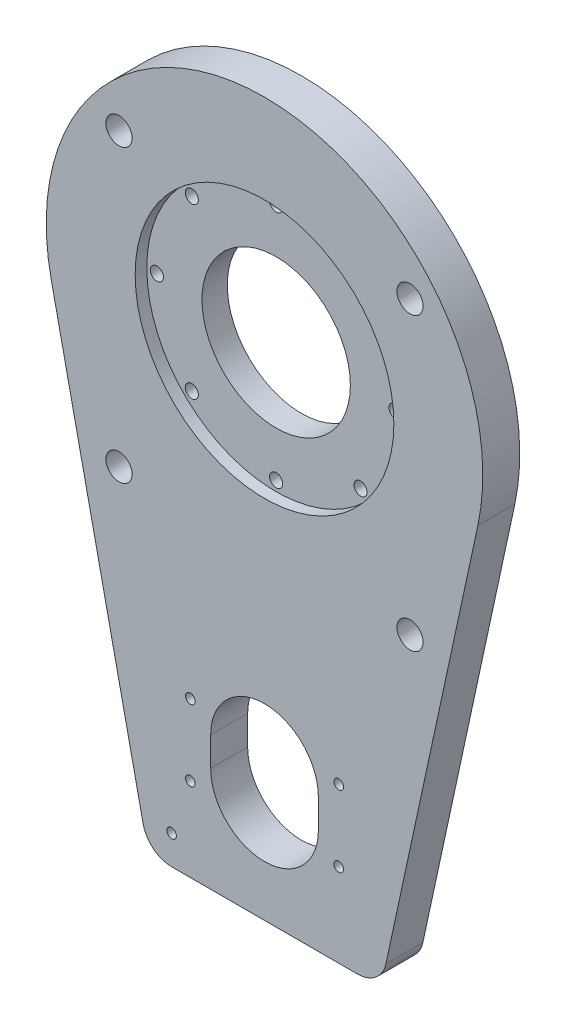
ISO-10303-21;
HEADER;
FILE_DESCRIPTION(('STEP AP214'),'2;1');
FILE_NAME('part.step','',(''),(''),'','','');
FILE_SCHEMA(('AUTOMOTIVE_DESIGN { 1 0 10303 214 1 1 1 1 }'));
ENDSEC;
DATA;
#1=APPLICATION_CONTEXT('core data for automotive mechanical design processes');
#2=APPLICATION_PROTOCOL_DEFINITION('international standard','automotive_design',2000,#1);
#3=PRODUCT_CONTEXT('',#1,'mechanical');
#4=PRODUCT('Part','Part','',(#3));
#5=PRODUCT_RELATED_PRODUCT_CATEGORY('part','',(#4));
#6=PRODUCT_DEFINITION_FORMATION('','',#4);
#7=PRODUCT_DEFINITION_CONTEXT('part definition',#1,'design');
#8=PRODUCT_DEFINITION('design','',#6,#7);
#9=PRODUCT_DEFINITION_SHAPE('','',#8);
#10=(LENGTH_UNIT() NAMED_UNIT(*) SI_UNIT(.MILLI.,.METRE.));
#11=(NAMED_UNIT(*) PLANE_ANGLE_UNIT() SI_UNIT($,.RADIAN.));
#12=(NAMED_UNIT(*) SI_UNIT($,.STERADIAN.) SOLID_ANGLE_UNIT());
#13=UNCERTAINTY_MEASURE_WITH_UNIT(LENGTH_MEASURE(1.E-05),#10,'distance_accuracy_value','');
#14=(GEOMETRIC_REPRESENTATION_CONTEXT(3) GLOBAL_UNCERTAINTY_ASSIGNED_CONTEXT((#13)) GLOBAL_UNIT_ASSIGNED_CONTEXT((#10,
#11,#12)) REPRESENTATION_CONTEXT('',''));
#15=CARTESIAN_POINT('',(0.,0.,0.));
#16=DIRECTION('',(0.,0.,1.));
#17=DIRECTION('',(1.,0.,0.));
#18=AXIS2_PLACEMENT_3D('',#15,#16,#17);
#19=CARTESIAN_POINT('',(0.,0.,0.));
#20=DIRECTION('',(0.,0.,1.));
#21=DIRECTION('',(1.,0.,0.));
#22=AXIS2_PLACEMENT_3D('',#19,#20,#21);
#23=PLANE('',#22);
#24=CARTESIAN_POINT('',(-28.9913780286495,28.9913780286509,0.));
#25=DIRECTION('',(0.,0.,-1.));
#26=DIRECTION('',(-1.,0.,0.));
#27=AXIS2_PLACEMENT_3D('',#24,#25,#26);
#28=CIRCLE('',#27,4.12500000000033);
#29=CARTESIAN_POINT('',(-33.1163780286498,28.9913780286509,0.));
#30=VERTEX_POINT('',#29);
#31=EDGE_CURVE('E420',#30,#30,#28,.T.);
#32=ORIENTED_EDGE('',*,*,#31,.F.);
#33=EDGE_LOOP('',(#32));
#34=FACE_BOUND('',#33,.T.);
#35=CARTESIAN_POINT('',(-41.0000000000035,3.49084920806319E-12,0.));
#36=DIRECTION('',(0.,0.,-1.));
#37=DIRECTION('',(-1.,0.,0.));
#38=AXIS2_PLACEMENT_3D('',#35,#36,#37);
#39=CIRCLE('',#38,4.12500000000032);
#40=CARTESIAN_POINT('',(-45.1250000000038,3.49084920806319E-12,0.));
#41=VERTEX_POINT('',#40);
#42=EDGE_CURVE('E221',#41,#41,#39,.T.);
#43=ORIENTED_EDGE('',*,*,#42,.F.);
#44=EDGE_LOOP('',(#43));
#45=FACE_BOUND('',#44,.T.);
#46=CARTESIAN_POINT('',(-28.9913780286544,-28.991378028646,0.));
#47=DIRECTION('',(0.,0.,-1.));
#48=DIRECTION('',(-1.,0.,0.));
#49=AXIS2_PLACEMENT_3D('',#46,#47,#48);
#50=CIRCLE('',#49,4.12500000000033);
#51=CARTESIAN_POINT('',(-33.1163780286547,-28.991378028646,0.));
#52=VERTEX_POINT('',#51);
#53=EDGE_CURVE('E216',#52,#52,#50,.T.);
#54=ORIENTED_EDGE('',*,*,#53,.F.);
#55=EDGE_LOOP('',(#54));
#56=FACE_BOUND('',#55,.T.);
#57=CARTESIAN_POINT('',(-6.98169841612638E-12,-41.,0.));
#58=DIRECTION('',(0.,0.,-1.));
#59=DIRECTION('',(-1.,0.,0.));
#60=AXIS2_PLACEMENT_3D('',#57,#58,#59);
#61=CIRCLE('',#60,4.12500000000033);
#62=CARTESIAN_POINT('',(-4.12500000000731,-41.,0.));
#63=VERTEX_POINT('',#62);
#64=EDGE_CURVE('E211',#63,#63,#61,.T.);
#65=ORIENTED_EDGE('',*,*,#64,.F.);
#66=EDGE_LOOP('',(#65));
#67=FACE_BOUND('',#66,.T.);
#68=CARTESIAN_POINT('',(28.9913780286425,-28.9913780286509,0.));
#69=DIRECTION('',(0.,0.,-1.));
#70=DIRECTION('',(-1.,0.,0.));
#71=AXIS2_PLACEMENT_3D('',#68,#69,#70);
#72=CIRCLE('',#71,4.12500000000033);
#73=CARTESIAN_POINT('',(24.8663780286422,-28.9913780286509,0.));
#74=VERTEX_POINT('',#73);
#75=EDGE_CURVE('E206',#74,#74,#72,.T.);
#76=ORIENTED_EDGE('',*,*,#75,.F.);
#77=EDGE_LOOP('',(#76));
#78=FACE_BOUND('',#77,.T.);
#79=CARTESIAN_POINT('',(40.9999999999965,-3.49587025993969E-12,0.));
#80=DIRECTION('',(0.,0.,-1.));
#81=DIRECTION('',(-1.,0.,0.));
#82=AXIS2_PLACEMENT_3D('',#79,#80,#81);
#83=CIRCLE('',#82,4.12500000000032);
#84=CARTESIAN_POINT('',(36.8749999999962,-3.49587025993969E-12,0.));
#85=VERTEX_POINT('',#84);
#86=EDGE_CURVE('E201',#85,#85,#83,.T.);
#87=ORIENTED_EDGE('',*,*,#86,.F.);
#88=EDGE_LOOP('',(#87));
#89=FACE_BOUND('',#88,.T.);
#90=CARTESIAN_POINT('',(28.9913780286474,28.991378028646,0.));
#91=DIRECTION('',(0.,0.,-1.));
#92=DIRECTION('',(-1.,0.,0.));
#93=AXIS2_PLACEMENT_3D('',#90,#91,#92);
#94=CIRCLE('',#93,4.12500000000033);
#95=CARTESIAN_POINT('',(24.8663780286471,28.991378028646,0.));
#96=VERTEX_POINT('',#95);
#97=EDGE_CURVE('E196',#96,#96,#94,.T.);
#98=ORIENTED_EDGE('',*,*,#97,.F.);
#99=EDGE_LOOP('',(#98));
#100=FACE_BOUND('',#99,.T.);
#101=CARTESIAN_POINT('',(0.,41.,0.));
#102=DIRECTION('',(0.,0.,-1.));
#103=DIRECTION('',(-1.,0.,0.));
#104=AXIS2_PLACEMENT_3D('',#101,#102,#103);
#105=CIRCLE('',#104,4.12500000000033);
#106=CARTESIAN_POINT('',(-4.12500000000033,41.,0.));
#107=VERTEX_POINT('',#106);
#108=EDGE_CURVE('E191',#107,#107,#105,.T.);
#109=ORIENTED_EDGE('',*,*,#108,.F.);
#110=EDGE_LOOP('',(#109));
#111=FACE_BOUND('',#110,.T.);
#112=CARTESIAN_POINT('',(0.,0.,0.));
#113=DIRECTION('',(0.,0.,1.));
#114=DIRECTION('',(1.,0.,0.));
#115=AXIS2_PLACEMENT_3D('',#112,#113,#114);
#116=CIRCLE('',#115,25.5);
#117=CARTESIAN_POINT('',(25.5,0.,0.));
#118=VERTEX_POINT('',#117);
#119=EDGE_CURVE('E356',#118,#118,#116,.T.);
#120=ORIENTED_EDGE('',*,*,#119,.T.);
#121=EDGE_LOOP('',(#120));
#122=FACE_BOUND('',#121,.T.);
#123=CARTESIAN_POINT('',(-31.9298733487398,-160.,0.));
#124=DIRECTION('',(0.,0.,1.));
#125=DIRECTION('',(1.,0.,0.));
#126=AXIS2_PLACEMENT_3D('',#123,#124,#125);
#127=CIRCLE('',#126,1.64999999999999);
#128=CARTESIAN_POINT('',(-30.2798733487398,-160.,0.));
#129=VERTEX_POINT('',#128);
#130=EDGE_CURVE('E352',#129,#129,#127,.T.);
#131=ORIENTED_EDGE('',*,*,#130,.T.);
#132=EDGE_LOOP('',(#131));
#133=FACE_BOUND('',#132,.T.);
#134=CARTESIAN_POINT('',(-25.5,-116.75,0.));
#135=DIRECTION('',(0.,0.,1.));
#136=DIRECTION('',(1.,0.,0.));
#137=AXIS2_PLACEMENT_3D('',#134,#135,#136);
#138=CIRCLE('',#137,1.64999999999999);
#139=CARTESIAN_POINT('',(-23.85,-116.75,0.));
#140=VERTEX_POINT('',#139);
#141=EDGE_CURVE('E348',#140,#140,#138,.T.);
#142=ORIENTED_EDGE('',*,*,#141,.T.);
#143=EDGE_LOOP('',(#142));
#144=FACE_BOUND('',#143,.T.);
#145=CARTESIAN_POINT('',(-25.5,-141.25,0.));
#146=DIRECTION('',(0.,0.,1.));
#147=DIRECTION('',(1.,0.,0.));
#148=AXIS2_PLACEMENT_3D('',#145,#146,#147);
#149=CIRCLE('',#148,1.64999999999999);
#150=CARTESIAN_POINT('',(-23.85,-141.25,0.));
#151=VERTEX_POINT('',#150);
#152=EDGE_CURVE('E344',#151,#151,#149,.T.);
#153=ORIENTED_EDGE('',*,*,#152,.T.);
#154=EDGE_LOOP('',(#153));
#155=FACE_BOUND('',#154,.T.);
#156=CARTESIAN_POINT('',(25.5,-116.75,0.));
#157=DIRECTION('',(0.,0.,1.));
#158=DIRECTION('',(1.,0.,0.));
#159=AXIS2_PLACEMENT_3D('',#156,#157,#158);
#160=CIRCLE('',#159,1.64999999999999);
#161=CARTESIAN_POINT('',(27.15,-116.75,0.));
#162=VERTEX_POINT('',#161);
#163=EDGE_CURVE('E340',#162,#162,#160,.T.);
#164=ORIENTED_EDGE('',*,*,#163,.T.);
#165=EDGE_LOOP('',(#164));
#166=FACE_BOUND('',#165,.T.);
#167=CARTESIAN_POINT('',(25.5,-141.25,0.));
#168=DIRECTION('',(0.,0.,1.));
#169=DIRECTION('',(1.,0.,0.));
#170=AXIS2_PLACEMENT_3D('',#167,#168,#169);
#171=CIRCLE('',#170,1.64999999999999);
#172=CARTESIAN_POINT('',(27.15,-141.25,0.));
#173=VERTEX_POINT('',#172);
#174=EDGE_CURVE('E336',#173,#173,#171,.T.);
#175=ORIENTED_EDGE('',*,*,#174,.T.);
#176=EDGE_LOOP('',(#175));
#177=FACE_BOUND('',#176,.T.);
#178=CARTESIAN_POINT('',(50.,-60.,0.));
#179=DIRECTION('',(0.,0.,-1.));
#180=DIRECTION('',(-1.,0.,0.));
#181=AXIS2_PLACEMENT_3D('',#178,#179,#180);
#182=CIRCLE('',#181,4.50000000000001);
#183=CARTESIAN_POINT('',(45.5,-60.,0.));
#184=VERTEX_POINT('',#183);
#185=EDGE_CURVE('E333',#184,#184,#182,.T.);
#186=ORIENTED_EDGE('',*,*,#185,.F.);
#187=EDGE_LOOP('',(#186));
#188=FACE_BOUND('',#187,.T.);
#189=CARTESIAN_POINT('',(-50.,-60.,0.));
#190=DIRECTION('',(0.,0.,-1.));
#191=DIRECTION('',(-1.,0.,0.));
#192=AXIS2_PLACEMENT_3D('',#189,#190,#191);
#193=CIRCLE('',#192,4.50000000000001);
#194=CARTESIAN_POINT('',(-54.5,-60.,0.));
#195=VERTEX_POINT('',#194);
#196=EDGE_CURVE('E329',#195,#195,#193,.T.);
#197=ORIENTED_EDGE('',*,*,#196,.F.);
#198=EDGE_LOOP('',(#197));
#199=FACE_BOUND('',#198,.T.);
#200=CARTESIAN_POINT('',(50.,40.,0.));
#201=DIRECTION('',(0.,0.,-1.));
#202=DIRECTION('',(-1.,0.,0.));
#203=AXIS2_PLACEMENT_3D('',#200,#201,#202);
#204=CIRCLE('',#203,4.50000000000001);
#205=CARTESIAN_POINT('',(45.5,40.,0.));
#206=VERTEX_POINT('',#205);
#207=EDGE_CURVE('E319',#206,#206,#204,.T.);
#208=ORIENTED_EDGE('',*,*,#207,.F.);
#209=EDGE_LOOP('',(#208));
#210=FACE_BOUND('',#209,.T.);
#211=DIRECTION('',(0.,-1.,0.));
#212=VECTOR('',#211,1.);
#213=CARTESIAN_POINT('',(18.5,-124.,0.));
#214=LINE('',#213,#212);
#215=CARTESIAN_POINT('',(18.5,-124.,0.));
#216=VERTEX_POINT('',#215);
#217=CARTESIAN_POINT('',(18.5,-134.,0.));
#218=VERTEX_POINT('',#217);
#219=EDGE_CURVE('E147',#216,#218,#214,.T.);
#220=ORIENTED_EDGE('',*,*,#219,.F.);
#221=CARTESIAN_POINT('',(0.,-124.,0.));
#222=DIRECTION('',(0.,0.,-1.));
#223=DIRECTION('',(-1.,0.,0.));
#224=AXIS2_PLACEMENT_3D('',#221,#222,#223);
#225=CIRCLE('',#224,18.5);
#226=CARTESIAN_POINT('',(-18.5,-124.,0.));
#227=VERTEX_POINT('',#226);
#228=EDGE_CURVE('E117',#227,#216,#225,.T.);
#229=ORIENTED_EDGE('',*,*,#228,.F.);
#230=DIRECTION('',(0.,1.,0.));
#231=VECTOR('',#230,1.);
#232=CARTESIAN_POINT('',(-18.5,-134.,0.));
#233=LINE('',#232,#231);
#234=CARTESIAN_POINT('',(-18.5,-134.,0.));
#235=VERTEX_POINT('',#234);
#236=EDGE_CURVE('E135',#235,#227,#233,.T.);
#237=ORIENTED_EDGE('',*,*,#236,.F.);
#238=CARTESIAN_POINT('',(0.,-134.,0.));
#239=DIRECTION('',(0.,0.,-1.));
#240=DIRECTION('',(-1.,0.,0.));
#241=AXIS2_PLACEMENT_3D('',#238,#239,#240);
#242=CIRCLE('',#241,18.5);
#243=EDGE_CURVE('E138',#218,#235,#242,.T.);
#244=ORIENTED_EDGE('',*,*,#243,.F.);
#245=EDGE_LOOP('',(#220,#229,#237,#244));
#246=FACE_BOUND('',#245,.T.);
#247=DIRECTION('',(1.,0.,0.));
#248=VECTOR('',#247,1.);
#249=CARTESIAN_POINT('',(-40.,-170.,0.));
#250=LINE('',#249,#248);
#251=CARTESIAN_POINT('',(-31.9298733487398,-170.,0.));
#252=VERTEX_POINT('',#251);
#253=CARTESIAN_POINT('',(31.9298733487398,-170.,0.));
#254=VERTEX_POINT('',#253);
#255=EDGE_CURVE('E157',#252,#254,#250,.T.);
#256=ORIENTED_EDGE('',*,*,#255,.F.);
#257=CARTESIAN_POINT('',(-31.9298733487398,-160.,0.));
#258=DIRECTION('',(0.,0.,1.));
#259=DIRECTION('',(1.,0.,0.));
#260=AXIS2_PLACEMENT_3D('',#257,#258,#259);
#261=CIRCLE('',#260,10.);
#262=CARTESIAN_POINT('',(-41.7043249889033,-162.111893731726,0.));
#263=VERTEX_POINT('',#262);
#264=EDGE_CURVE('E41',#252,#263,#261,.F.);
#265=ORIENTED_EDGE('',*,*,#264,.T.);
#266=DIRECTION('',(0.211189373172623,-0.977445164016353,0.));
#267=VECTOR('',#266,1.);
#268=CARTESIAN_POINT('',(-73.3083873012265,-15.8392029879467,0.));
#269=LINE('',#268,#267);
#270=CARTESIAN_POINT('',(-73.3083873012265,-15.8392029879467,0.));
#271=VERTEX_POINT('',#270);
#272=EDGE_CURVE('E165',#271,#263,#269,.T.);
#273=ORIENTED_EDGE('',*,*,#272,.F.);
#274=CARTESIAN_POINT('',(0.,0.,0.));
#275=DIRECTION('',(0.,0.,1.));
#276=DIRECTION('',(1.,0.,0.));
#277=AXIS2_PLACEMENT_3D('',#274,#275,#276);
#278=CIRCLE('',#277,75.);
#279=CARTESIAN_POINT('',(73.3083873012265,-15.8392029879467,0.));
#280=VERTEX_POINT('',#279);
#281=EDGE_CURVE('E162',#280,#271,#278,.T.);
#282=ORIENTED_EDGE('',*,*,#281,.F.);
#283=DIRECTION('',(0.211189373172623,0.977445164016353,0.));
#284=VECTOR('',#283,1.);
#285=CARTESIAN_POINT('',(40.,-170.,0.));
#286=LINE('',#285,#284);
#287=CARTESIAN_POINT('',(41.7043249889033,-162.111893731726,0.));
#288=VERTEX_POINT('',#287);
#289=EDGE_CURVE('E159',#288,#280,#286,.T.);
#290=ORIENTED_EDGE('',*,*,#289,.F.);
#291=CARTESIAN_POINT('',(31.9298733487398,-160.,0.));
#292=DIRECTION('',(0.,0.,1.));
#293=DIRECTION('',(1.,0.,0.));
#294=AXIS2_PLACEMENT_3D('',#291,#292,#293);
#295=CIRCLE('',#294,10.);
#296=EDGE_CURVE('E53',#288,#254,#295,.F.);
#297=ORIENTED_EDGE('',*,*,#296,.T.);
#298=EDGE_LOOP('',(#256,#265,#273,#282,#290,#297));
#299=FACE_BOUND('',#298,.T.);
#300=CARTESIAN_POINT('',(-50.,40.,0.));
#301=DIRECTION('',(0.,0.,-1.));
#302=DIRECTION('',(-1.,0.,0.));
#303=AXIS2_PLACEMENT_3D('',#300,#301,#302);
#304=CIRCLE('',#303,4.50000000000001);
#305=CARTESIAN_POINT('',(-54.5,40.,0.));
#306=VERTEX_POINT('',#305);
#307=EDGE_CURVE('E323',#306,#306,#304,.T.);
#308=ORIENTED_EDGE('',*,*,#307,.F.);
#309=EDGE_LOOP('',(#308));
#310=FACE_BOUND('',#309,.T.);
#311=ADVANCED_FACE('F33',(#34,#45,#56,#67,#78,#89,#100,#111,#122,#133,#144,#155,#166,#177,#188,
#199,#210,#246,#299,#310),#23,.F.);
#312=CARTESIAN_POINT('',(-40.,-170.,0.));
#313=DIRECTION('',(0.,-1.,0.));
#314=DIRECTION('',(0.,0.,-1.));
#315=AXIS2_PLACEMENT_3D('',#312,#313,#314);
#316=PLANE('',#315);
#317=DIRECTION('',(1.,0.,0.));
#318=VECTOR('',#317,1.);
#319=CARTESIAN_POINT('',(-40.,-170.,12.7));
#320=LINE('',#319,#318);
#321=CARTESIAN_POINT('',(-31.9298733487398,-170.,12.7));
#322=VERTEX_POINT('',#321);
#323=CARTESIAN_POINT('',(31.9298733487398,-170.,12.7));
#324=VERTEX_POINT('',#323);
#325=EDGE_CURVE('E153',#322,#324,#320,.T.);
#326=ORIENTED_EDGE('',*,*,#325,.F.);
#327=DIRECTION('',(0.,0.,1.));
#328=VECTOR('',#327,1.);
#329=CARTESIAN_POINT('',(-31.9298733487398,-170.,0.));
#330=LINE('',#329,#328);
#331=EDGE_CURVE('E232',#322,#252,#330,.F.);
#332=ORIENTED_EDGE('',*,*,#331,.T.);
#333=ORIENTED_EDGE('',*,*,#255,.T.);
#334=DIRECTION('',(0.,0.,1.));
#335=VECTOR('',#334,1.);
#336=CARTESIAN_POINT('',(31.9298733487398,-170.,0.));
#337=LINE('',#336,#335);
#338=EDGE_CURVE('E229',#254,#324,#337,.T.);
#339=ORIENTED_EDGE('',*,*,#338,.T.);
#340=EDGE_LOOP('',(#326,#332,#333,#339));
#341=FACE_BOUND('',#340,.T.);
#342=ADVANCED_FACE('F247',(#341),#316,.T.);
#343=CARTESIAN_POINT('',(-73.3083873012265,-15.8392029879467,0.));
#344=DIRECTION('',(-0.977445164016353,-0.211189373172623,0.));
#345=DIRECTION('',(0.211189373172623,-0.977445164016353,0.));
#346=AXIS2_PLACEMENT_3D('',#343,#344,#345);
#347=PLANE('',#346);
#348=ORIENTED_EDGE('',*,*,#272,.T.);
#349=DIRECTION('',(0.,0.,1.));
#350=VECTOR('',#349,1.);
#351=CARTESIAN_POINT('',(-41.7043249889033,-162.111893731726,0.));
#352=LINE('',#351,#350);
#353=CARTESIAN_POINT('',(-41.7043249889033,-162.111893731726,12.7));
#354=VERTEX_POINT('',#353);
#355=EDGE_CURVE('E180',#263,#354,#352,.T.);
#356=ORIENTED_EDGE('',*,*,#355,.T.);
#357=DIRECTION('',(0.211189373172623,-0.977445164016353,0.));
#358=VECTOR('',#357,1.);
#359=CARTESIAN_POINT('',(-73.3083873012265,-15.8392029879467,12.7));
#360=LINE('',#359,#358);
#361=CARTESIAN_POINT('',(-73.3083873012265,-15.8392029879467,12.7));
#362=VERTEX_POINT('',#361);
#363=EDGE_CURVE('E160',#362,#354,#360,.T.);
#364=ORIENTED_EDGE('',*,*,#363,.F.);
#365=DIRECTION('',(0.,0.,1.));
#366=VECTOR('',#365,1.);
#367=CARTESIAN_POINT('',(-73.3083873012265,-15.8392029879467,0.));
#368=LINE('',#367,#366);
#369=EDGE_CURVE('E178',#271,#362,#368,.T.);
#370=ORIENTED_EDGE('',*,*,#369,.F.);
#371=EDGE_LOOP('',(#348,#356,#364,#370));
#372=FACE_BOUND('',#371,.T.);
#373=ADVANCED_FACE('F242',(#372),#347,.T.);
#374=CARTESIAN_POINT('',(0.,0.,0.));
#375=DIRECTION('',(0.,0.,1.));
#376=DIRECTION('',(1.,0.,0.));
#377=AXIS2_PLACEMENT_3D('',#374,#375,#376);
#378=CYLINDRICAL_SURFACE('',#377,75.);
#379=CARTESIAN_POINT('',(0.,0.,12.7));
#380=DIRECTION('',(0.,0.,1.));
#381=DIRECTION('',(1.,0.,0.));
#382=AXIS2_PLACEMENT_3D('',#379,#380,#381);
#383=CIRCLE('',#382,75.);
#384=CARTESIAN_POINT('',(73.3083873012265,-15.8392029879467,12.7));
#385=VERTEX_POINT('',#384);
#386=EDGE_CURVE('E173',#385,#362,#383,.T.);
#387=ORIENTED_EDGE('',*,*,#386,.F.);
#388=DIRECTION('',(0.,0.,1.));
#389=VECTOR('',#388,1.);
#390=CARTESIAN_POINT('',(73.3083873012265,-15.8392029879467,0.));
#391=LINE('',#390,#389);
#392=EDGE_CURVE('E168',#280,#385,#391,.T.);
#393=ORIENTED_EDGE('',*,*,#392,.F.);
#394=ORIENTED_EDGE('',*,*,#281,.T.);
#395=ORIENTED_EDGE('',*,*,#369,.T.);
#396=EDGE_LOOP('',(#387,#393,#394,#395));
#397=FACE_BOUND('',#396,.T.);
#398=ADVANCED_FACE('F254',(#397),#378,.T.);
#399=CARTESIAN_POINT('',(40.,-170.,0.));
#400=DIRECTION('',(0.977445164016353,-0.211189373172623,0.));
#401=DIRECTION('',(0.211189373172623,0.977445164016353,0.));
#402=AXIS2_PLACEMENT_3D('',#399,#400,#401);
#403=PLANE('',#402);
#404=DIRECTION('',(0.211189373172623,0.977445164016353,0.));
#405=VECTOR('',#404,1.);
#406=CARTESIAN_POINT('',(40.,-170.,12.7));
#407=LINE('',#406,#405);
#408=CARTESIAN_POINT('',(41.7043249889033,-162.111893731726,12.7));
#409=VERTEX_POINT('',#408);
#410=EDGE_CURVE('E171',#409,#385,#407,.T.);
#411=ORIENTED_EDGE('',*,*,#410,.F.);
#412=DIRECTION('',(0.,0.,1.));
#413=VECTOR('',#412,1.);
#414=CARTESIAN_POINT('',(41.7043249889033,-162.111893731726,0.));
#415=LINE('',#414,#413);
#416=EDGE_CURVE('E11',#409,#288,#415,.F.);
#417=ORIENTED_EDGE('',*,*,#416,.T.);
#418=ORIENTED_EDGE('',*,*,#289,.T.);
#419=ORIENTED_EDGE('',*,*,#392,.T.);
#420=EDGE_LOOP('',(#411,#417,#418,#419));
#421=FACE_BOUND('',#420,.T.);
#422=ADVANCED_FACE('F250',(#421),#403,.T.);
#423=CARTESIAN_POINT('',(0.,0.,12.7));
#424=DIRECTION('',(0.,0.,1.));
#425=DIRECTION('',(1.,0.,0.));
#426=AXIS2_PLACEMENT_3D('',#423,#424,#425);
#427=PLANE('',#426);
#428=CARTESIAN_POINT('',(0.,0.,12.7));
#429=DIRECTION('',(0.,0.,1.));
#430=DIRECTION('',(1.,0.,0.));
#431=AXIS2_PLACEMENT_3D('',#428,#429,#430);
#432=CIRCLE('',#431,44.45);
#433=CARTESIAN_POINT('',(44.45,0.,12.7));
#434=VERTEX_POINT('',#433);
#435=EDGE_CURVE('E186',#434,#434,#432,.T.);
#436=ORIENTED_EDGE('',*,*,#435,.F.);
#437=EDGE_LOOP('',(#436));
#438=FACE_BOUND('',#437,.T.);
#439=CARTESIAN_POINT('',(-31.9298733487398,-160.,12.7));
#440=DIRECTION('',(0.,0.,1.));
#441=DIRECTION('',(1.,0.,0.));
#442=AXIS2_PLACEMENT_3D('',#439,#440,#441);
#443=CIRCLE('',#442,1.64999999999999);
#444=CARTESIAN_POINT('',(-30.2798733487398,-160.,12.7));
#445=VERTEX_POINT('',#444);
#446=EDGE_CURVE('E287',#445,#445,#443,.T.);
#447=ORIENTED_EDGE('',*,*,#446,.F.);
#448=EDGE_LOOP('',(#447));
#449=FACE_BOUND('',#448,.T.);
#450=CARTESIAN_POINT('',(-25.5,-116.75,12.7));
#451=DIRECTION('',(0.,0.,1.));
#452=DIRECTION('',(1.,0.,0.));
#453=AXIS2_PLACEMENT_3D('',#450,#451,#452);
#454=CIRCLE('',#453,1.64999999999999);
#455=CARTESIAN_POINT('',(-23.85,-116.75,12.7));
#456=VERTEX_POINT('',#455);
#457=EDGE_CURVE('E291',#456,#456,#454,.T.);
#458=ORIENTED_EDGE('',*,*,#457,.F.);
#459=EDGE_LOOP('',(#458));
#460=FACE_BOUND('',#459,.T.);
#461=CARTESIAN_POINT('',(-25.5,-141.25,12.7));
#462=DIRECTION('',(0.,0.,1.));
#463=DIRECTION('',(1.,0.,0.));
#464=AXIS2_PLACEMENT_3D('',#461,#462,#463);
#465=CIRCLE('',#464,1.64999999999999);
#466=CARTESIAN_POINT('',(-23.85,-141.25,12.7));
#467=VERTEX_POINT('',#466);
#468=EDGE_CURVE('E295',#467,#467,#465,.T.);
#469=ORIENTED_EDGE('',*,*,#468,.F.);
#470=EDGE_LOOP('',(#469));
#471=FACE_BOUND('',#470,.T.);
#472=CARTESIAN_POINT('',(25.5,-116.75,12.7));
#473=DIRECTION('',(0.,0.,1.));
#474=DIRECTION('',(1.,0.,0.));
#475=AXIS2_PLACEMENT_3D('',#472,#473,#474);
#476=CIRCLE('',#475,1.64999999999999);
#477=CARTESIAN_POINT('',(27.15,-116.75,12.7));
#478=VERTEX_POINT('',#477);
#479=EDGE_CURVE('E299',#478,#478,#476,.T.);
#480=ORIENTED_EDGE('',*,*,#479,.F.);
#481=EDGE_LOOP('',(#480));
#482=FACE_BOUND('',#481,.T.);
#483=CARTESIAN_POINT('',(25.5,-141.25,12.7));
#484=DIRECTION('',(0.,0.,1.));
#485=DIRECTION('',(1.,0.,0.));
#486=AXIS2_PLACEMENT_3D('',#483,#484,#485);
#487=CIRCLE('',#486,1.64999999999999);
#488=CARTESIAN_POINT('',(27.15,-141.25,12.7));
#489=VERTEX_POINT('',#488);
#490=EDGE_CURVE('E303',#489,#489,#487,.T.);
#491=ORIENTED_EDGE('',*,*,#490,.F.);
#492=EDGE_LOOP('',(#491));
#493=FACE_BOUND('',#492,.T.);
#494=CARTESIAN_POINT('',(50.,-60.,12.7));
#495=DIRECTION('',(0.,0.,-1.));
#496=DIRECTION('',(-1.,0.,0.));
#497=AXIS2_PLACEMENT_3D('',#494,#495,#496);
#498=CIRCLE('',#497,4.50000000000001);
#499=CARTESIAN_POINT('',(45.5,-60.,12.7));
#500=VERTEX_POINT('',#499);
#501=EDGE_CURVE('E307',#500,#500,#498,.T.);
#502=ORIENTED_EDGE('',*,*,#501,.T.);
#503=EDGE_LOOP('',(#502));
#504=FACE_BOUND('',#503,.T.);
#505=CARTESIAN_POINT('',(-50.,-60.,12.7));
#506=DIRECTION('',(0.,0.,-1.));
#507=DIRECTION('',(-1.,0.,0.));
#508=AXIS2_PLACEMENT_3D('',#505,#506,#507);
#509=CIRCLE('',#508,4.50000000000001);
#510=CARTESIAN_POINT('',(-54.5,-60.,12.7));
#511=VERTEX_POINT('',#510);
#512=EDGE_CURVE('E311',#511,#511,#509,.T.);
#513=ORIENTED_EDGE('',*,*,#512,.T.);
#514=EDGE_LOOP('',(#513));
#515=FACE_BOUND('',#514,.T.);
#516=CARTESIAN_POINT('',(-50.,40.,12.7));
#517=DIRECTION('',(0.,0.,-1.));
#518=DIRECTION('',(-1.,0.,0.));
#519=AXIS2_PLACEMENT_3D('',#516,#517,#518);
#520=CIRCLE('',#519,4.50000000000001);
#521=CARTESIAN_POINT('',(-54.5,40.,12.7));
#522=VERTEX_POINT('',#521);
#523=EDGE_CURVE('E315',#522,#522,#520,.T.);
#524=ORIENTED_EDGE('',*,*,#523,.T.);
#525=EDGE_LOOP('',(#524));
#526=FACE_BOUND('',#525,.T.);
#527=CARTESIAN_POINT('',(50.,40.,12.7));
#528=DIRECTION('',(0.,0.,-1.));
#529=DIRECTION('',(-1.,0.,0.));
#530=AXIS2_PLACEMENT_3D('',#527,#528,#529);
#531=CIRCLE('',#530,4.50000000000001);
#532=CARTESIAN_POINT('',(45.5,40.,12.7));
#533=VERTEX_POINT('',#532);
#534=EDGE_CURVE('E141',#533,#533,#531,.T.);
#535=ORIENTED_EDGE('',*,*,#534,.T.);
#536=EDGE_LOOP('',(#535));
#537=FACE_BOUND('',#536,.T.);
#538=CARTESIAN_POINT('',(0.,-124.,12.7));
#539=DIRECTION('',(0.,0.,-1.));
#540=DIRECTION('',(-1.,0.,0.));
#541=AXIS2_PLACEMENT_3D('',#538,#539,#540);
#542=CIRCLE('',#541,18.5);
#543=CARTESIAN_POINT('',(-18.5,-124.,12.7));
#544=VERTEX_POINT('',#543);
#545=CARTESIAN_POINT('',(18.5,-124.,12.7));
#546=VERTEX_POINT('',#545);
#547=EDGE_CURVE('E114',#544,#546,#542,.T.);
#548=ORIENTED_EDGE('',*,*,#547,.T.);
#549=DIRECTION('',(0.,-1.,0.));
#550=VECTOR('',#549,1.);
#551=CARTESIAN_POINT('',(18.5,-124.,12.7));
#552=LINE('',#551,#550);
#553=CARTESIAN_POINT('',(18.5,-134.,12.7));
#554=VERTEX_POINT('',#553);
#555=EDGE_CURVE('E126',#546,#554,#552,.T.);
#556=ORIENTED_EDGE('',*,*,#555,.T.);
#557=CARTESIAN_POINT('',(0.,-134.,12.7));
#558=DIRECTION('',(0.,0.,-1.));
#559=DIRECTION('',(-1.,0.,0.));
#560=AXIS2_PLACEMENT_3D('',#557,#558,#559);
#561=CIRCLE('',#560,18.5);
#562=CARTESIAN_POINT('',(-18.5,-134.,12.7));
#563=VERTEX_POINT('',#562);
#564=EDGE_CURVE('E130',#554,#563,#561,.T.);
#565=ORIENTED_EDGE('',*,*,#564,.T.);
#566=DIRECTION('',(0.,1.,0.));
#567=VECTOR('',#566,1.);
#568=CARTESIAN_POINT('',(-18.5,-134.,12.7));
#569=LINE('',#568,#567);
#570=EDGE_CURVE('E122',#563,#544,#569,.T.);
#571=ORIENTED_EDGE('',*,*,#570,.T.);
#572=EDGE_LOOP('',(#548,#556,#565,#571));
#573=FACE_BOUND('',#572,.T.);
#574=ORIENTED_EDGE('',*,*,#363,.T.);
#575=CARTESIAN_POINT('',(-31.9298733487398,-160.,12.7));
#576=DIRECTION('',(0.,0.,1.));
#577=DIRECTION('',(1.,0.,0.));
#578=AXIS2_PLACEMENT_3D('',#575,#576,#577);
#579=CIRCLE('',#578,10.);
#580=EDGE_CURVE('E227',#354,#322,#579,.T.);
#581=ORIENTED_EDGE('',*,*,#580,.T.);
#582=ORIENTED_EDGE('',*,*,#325,.T.);
#583=CARTESIAN_POINT('',(31.9298733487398,-160.,12.7));
#584=DIRECTION('',(0.,0.,1.));
#585=DIRECTION('',(1.,0.,0.));
#586=AXIS2_PLACEMENT_3D('',#583,#584,#585);
#587=CIRCLE('',#586,10.);
#588=EDGE_CURVE('E225',#324,#409,#587,.T.);
#589=ORIENTED_EDGE('',*,*,#588,.T.);
#590=ORIENTED_EDGE('',*,*,#410,.T.);
#591=ORIENTED_EDGE('',*,*,#386,.T.);
#592=EDGE_LOOP('',(#574,#581,#582,#589,#590,#591));
#593=FACE_BOUND('',#592,.T.);
#594=ADVANCED_FACE('F132',(#438,#449,#460,#471,#482,#493,#504,#515,#526,#537,#573,#593),#427,.T.);
#595=CARTESIAN_POINT('',(0.,-124.,12.7));
#596=DIRECTION('',(0.,0.,-1.));
#597=DIRECTION('',(-1.,0.,0.));
#598=AXIS2_PLACEMENT_3D('',#595,#596,#597);
#599=CYLINDRICAL_SURFACE('',#598,18.5);
#600=ORIENTED_EDGE('',*,*,#228,.T.);
#601=DIRECTION('',(0.,0.,-1.));
#602=VECTOR('',#601,1.);
#603=CARTESIAN_POINT('',(18.5,-124.,12.7));
#604=LINE('',#603,#602);
#605=EDGE_CURVE('E110',#546,#216,#604,.T.);
#606=ORIENTED_EDGE('',*,*,#605,.F.);
#607=ORIENTED_EDGE('',*,*,#547,.F.);
#608=DIRECTION('',(0.,0.,-1.));
#609=VECTOR('',#608,1.);
#610=CARTESIAN_POINT('',(-18.5,-124.,12.7));
#611=LINE('',#610,#609);
#612=EDGE_CURVE('E151',#544,#227,#611,.T.);
#613=ORIENTED_EDGE('',*,*,#612,.T.);
#614=EDGE_LOOP('',(#600,#606,#607,#613));
#615=FACE_BOUND('',#614,.T.);
#616=ADVANCED_FACE('F112',(#615),#599,.F.);
#617=CARTESIAN_POINT('',(-18.5,-134.,12.7));
#618=DIRECTION('',(-1.,0.,0.));
#619=DIRECTION('',(0.,-1.,0.));
#620=AXIS2_PLACEMENT_3D('',#617,#618,#619);
#621=PLANE('',#620);
#622=ORIENTED_EDGE('',*,*,#236,.T.);
#623=ORIENTED_EDGE('',*,*,#612,.F.);
#624=ORIENTED_EDGE('',*,*,#570,.F.);
#625=DIRECTION('',(0.,0.,-1.));
#626=VECTOR('',#625,1.);
#627=CARTESIAN_POINT('',(-18.5,-134.,12.7));
#628=LINE('',#627,#626);
#629=EDGE_CURVE('E154',#563,#235,#628,.T.);
#630=ORIENTED_EDGE('',*,*,#629,.T.);
#631=EDGE_LOOP('',(#622,#623,#624,#630));
#632=FACE_BOUND('',#631,.T.);
#633=ADVANCED_FACE('F280',(#632),#621,.F.);
#634=CARTESIAN_POINT('',(0.,-134.,12.7));
#635=DIRECTION('',(0.,0.,-1.));
#636=DIRECTION('',(-1.,0.,0.));
#637=AXIS2_PLACEMENT_3D('',#634,#635,#636);
#638=CYLINDRICAL_SURFACE('',#637,18.5);
#639=ORIENTED_EDGE('',*,*,#243,.T.);
#640=ORIENTED_EDGE('',*,*,#629,.F.);
#641=ORIENTED_EDGE('',*,*,#564,.F.);
#642=DIRECTION('',(0.,0.,-1.));
#643=VECTOR('',#642,1.);
#644=CARTESIAN_POINT('',(18.5,-134.,12.7));
#645=LINE('',#644,#643);
#646=EDGE_CURVE('E121',#554,#218,#645,.T.);
#647=ORIENTED_EDGE('',*,*,#646,.T.);
#648=EDGE_LOOP('',(#639,#640,#641,#647));
#649=FACE_BOUND('',#648,.T.);
#650=ADVANCED_FACE('F573',(#649),#638,.F.);
#651=CARTESIAN_POINT('',(18.5,-124.,12.7));
#652=DIRECTION('',(1.,0.,0.));
#653=DIRECTION('',(0.,1.,0.));
#654=AXIS2_PLACEMENT_3D('',#651,#652,#653);
#655=PLANE('',#654);
#656=ORIENTED_EDGE('',*,*,#219,.T.);
#657=ORIENTED_EDGE('',*,*,#646,.F.);
#658=ORIENTED_EDGE('',*,*,#555,.F.);
#659=ORIENTED_EDGE('',*,*,#605,.T.);
#660=EDGE_LOOP('',(#656,#657,#658,#659));
#661=FACE_BOUND('',#660,.T.);
#662=ADVANCED_FACE('F127',(#661),#655,.F.);
#663=CARTESIAN_POINT('',(50.,40.,0.));
#664=DIRECTION('',(0.,0.,-1.));
#665=DIRECTION('',(-1.,0.,0.));
#666=AXIS2_PLACEMENT_3D('',#663,#664,#665);
#667=CYLINDRICAL_SURFACE('',#666,4.50000000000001);
#668=ORIENTED_EDGE('',*,*,#534,.F.);
#669=EDGE_LOOP('',(#668));
#670=FACE_BOUND('',#669,.T.);
#671=ORIENTED_EDGE('',*,*,#207,.T.);
#672=EDGE_LOOP('',(#671));
#673=FACE_BOUND('',#672,.T.);
#674=ADVANCED_FACE('F567',(#670,#673),#667,.F.);
#675=CARTESIAN_POINT('',(-50.,40.,0.));
#676=DIRECTION('',(0.,0.,-1.));
#677=DIRECTION('',(-1.,0.,0.));
#678=AXIS2_PLACEMENT_3D('',#675,#676,#677);
#679=CYLINDRICAL_SURFACE('',#678,4.50000000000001);
#680=ORIENTED_EDGE('',*,*,#523,.F.);
#681=EDGE_LOOP('',(#680));
#682=FACE_BOUND('',#681,.T.);
#683=ORIENTED_EDGE('',*,*,#307,.T.);
#684=EDGE_LOOP('',(#683));
#685=FACE_BOUND('',#684,.T.);
#686=ADVANCED_FACE('F563',(#682,#685),#679,.F.);
#687=CARTESIAN_POINT('',(-50.,-60.,0.));
#688=DIRECTION('',(0.,0.,-1.));
#689=DIRECTION('',(-1.,0.,0.));
#690=AXIS2_PLACEMENT_3D('',#687,#688,#689);
#691=CYLINDRICAL_SURFACE('',#690,4.50000000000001);
#692=ORIENTED_EDGE('',*,*,#512,.F.);
#693=EDGE_LOOP('',(#692));
#694=FACE_BOUND('',#693,.T.);
#695=ORIENTED_EDGE('',*,*,#196,.T.);
#696=EDGE_LOOP('',(#695));
#697=FACE_BOUND('',#696,.T.);
#698=ADVANCED_FACE('F559',(#694,#697),#691,.F.);
#699=CARTESIAN_POINT('',(50.,-60.,0.));
#700=DIRECTION('',(0.,0.,-1.));
#701=DIRECTION('',(-1.,0.,0.));
#702=AXIS2_PLACEMENT_3D('',#699,#700,#701);
#703=CYLINDRICAL_SURFACE('',#702,4.50000000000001);
#704=ORIENTED_EDGE('',*,*,#501,.F.);
#705=EDGE_LOOP('',(#704));
#706=FACE_BOUND('',#705,.T.);
#707=ORIENTED_EDGE('',*,*,#185,.T.);
#708=EDGE_LOOP('',(#707));
#709=FACE_BOUND('',#708,.T.);
#710=ADVANCED_FACE('F555',(#706,#709),#703,.F.);
#711=CARTESIAN_POINT('',(25.5,-141.25,12.7));
#712=DIRECTION('',(0.,0.,1.));
#713=DIRECTION('',(1.,0.,0.));
#714=AXIS2_PLACEMENT_3D('',#711,#712,#713);
#715=CYLINDRICAL_SURFACE('',#714,1.64999999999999);
#716=ORIENTED_EDGE('',*,*,#174,.F.);
#717=EDGE_LOOP('',(#716));
#718=FACE_BOUND('',#717,.T.);
#719=ORIENTED_EDGE('',*,*,#490,.T.);
#720=EDGE_LOOP('',(#719));
#721=FACE_BOUND('',#720,.T.);
#722=ADVANCED_FACE('F551',(#718,#721),#715,.F.);
#723=CARTESIAN_POINT('',(25.5,-116.75,12.7));
#724=DIRECTION('',(0.,0.,1.));
#725=DIRECTION('',(1.,0.,0.));
#726=AXIS2_PLACEMENT_3D('',#723,#724,#725);
#727=CYLINDRICAL_SURFACE('',#726,1.64999999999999);
#728=ORIENTED_EDGE('',*,*,#163,.F.);
#729=EDGE_LOOP('',(#728));
#730=FACE_BOUND('',#729,.T.);
#731=ORIENTED_EDGE('',*,*,#479,.T.);
#732=EDGE_LOOP('',(#731));
#733=FACE_BOUND('',#732,.T.);
#734=ADVANCED_FACE('F547',(#730,#733),#727,.F.);
#735=CARTESIAN_POINT('',(-25.5,-141.25,12.7));
#736=DIRECTION('',(0.,0.,1.));
#737=DIRECTION('',(1.,0.,0.));
#738=AXIS2_PLACEMENT_3D('',#735,#736,#737);
#739=CYLINDRICAL_SURFACE('',#738,1.64999999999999);
#740=ORIENTED_EDGE('',*,*,#152,.F.);
#741=EDGE_LOOP('',(#740));
#742=FACE_BOUND('',#741,.T.);
#743=ORIENTED_EDGE('',*,*,#468,.T.);
#744=EDGE_LOOP('',(#743));
#745=FACE_BOUND('',#744,.T.);
#746=ADVANCED_FACE('F543',(#742,#745),#739,.F.);
#747=CARTESIAN_POINT('',(-25.5,-116.75,12.7));
#748=DIRECTION('',(0.,0.,1.));
#749=DIRECTION('',(1.,0.,0.));
#750=AXIS2_PLACEMENT_3D('',#747,#748,#749);
#751=CYLINDRICAL_SURFACE('',#750,1.64999999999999);
#752=ORIENTED_EDGE('',*,*,#141,.F.);
#753=EDGE_LOOP('',(#752));
#754=FACE_BOUND('',#753,.T.);
#755=ORIENTED_EDGE('',*,*,#457,.T.);
#756=EDGE_LOOP('',(#755));
#757=FACE_BOUND('',#756,.T.);
#758=ADVANCED_FACE('F539',(#754,#757),#751,.F.);
#759=CARTESIAN_POINT('',(-31.9298733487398,-160.,12.7));
#760=DIRECTION('',(0.,0.,1.));
#761=DIRECTION('',(1.,0.,0.));
#762=AXIS2_PLACEMENT_3D('',#759,#760,#761);
#763=CYLINDRICAL_SURFACE('',#762,1.64999999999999);
#764=ORIENTED_EDGE('',*,*,#130,.F.);
#765=EDGE_LOOP('',(#764));
#766=FACE_BOUND('',#765,.T.);
#767=ORIENTED_EDGE('',*,*,#446,.T.);
#768=EDGE_LOOP('',(#767));
#769=FACE_BOUND('',#768,.T.);
#770=ADVANCED_FACE('F535',(#766,#769),#763,.F.);
#771=CARTESIAN_POINT('',(0.,0.,12.7));
#772=DIRECTION('',(0.,0.,1.));
#773=DIRECTION('',(1.,0.,0.));
#774=AXIS2_PLACEMENT_3D('',#771,#772,#773);
#775=CYLINDRICAL_SURFACE('',#774,25.5);
#776=ORIENTED_EDGE('',*,*,#119,.F.);
#777=EDGE_LOOP('',(#776));
#778=FACE_BOUND('',#777,.T.);
#779=CARTESIAN_POINT('',(0.,0.,8.69999999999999));
#780=DIRECTION('',(0.,0.,1.));
#781=DIRECTION('',(1.,0.,0.));
#782=AXIS2_PLACEMENT_3D('',#779,#780,#781);
#783=CIRCLE('',#782,25.5);
#784=CARTESIAN_POINT('',(25.5,0.,8.69999999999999));
#785=VERTEX_POINT('',#784);
#786=EDGE_CURVE('E359',#785,#785,#783,.T.);
#787=ORIENTED_EDGE('',*,*,#786,.T.);
#788=EDGE_LOOP('',(#787));
#789=FACE_BOUND('',#788,.T.);
#790=ADVANCED_FACE('F531',(#778,#789),#775,.F.);
#791=CARTESIAN_POINT('',(25.5,0.,8.69999999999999));
#792=DIRECTION('',(0.,0.,-1.));
#793=DIRECTION('',(-1.,0.,0.));
#794=AXIS2_PLACEMENT_3D('',#791,#792,#793);
#795=PLANE('',#794);
#796=CARTESIAN_POINT('',(-28.9913780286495,28.9913780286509,8.69999999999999));
#797=DIRECTION('',(0.,0.,-1.));
#798=DIRECTION('',(-1.,0.,0.));
#799=AXIS2_PLACEMENT_3D('',#796,#797,#798);
#800=CIRCLE('',#799,2.2500000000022);
#801=CARTESIAN_POINT('',(-31.2413780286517,28.9913780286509,8.69999999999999));
#802=VERTEX_POINT('',#801);
#803=EDGE_CURVE('E218',#802,#802,#800,.T.);
#804=ORIENTED_EDGE('',*,*,#803,.T.);
#805=EDGE_LOOP('',(#804));
#806=FACE_BOUND('',#805,.T.);
#807=CARTESIAN_POINT('',(-41.0000000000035,3.49084920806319E-12,8.69999999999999));
#808=DIRECTION('',(0.,0.,-1.));
#809=DIRECTION('',(-1.,0.,0.));
#810=AXIS2_PLACEMENT_3D('',#807,#808,#809);
#811=CIRCLE('',#810,2.2500000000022);
#812=CARTESIAN_POINT('',(-43.2500000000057,3.49084920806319E-12,8.69999999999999));
#813=VERTEX_POINT('',#812);
#814=EDGE_CURVE('E213',#813,#813,#811,.T.);
#815=ORIENTED_EDGE('',*,*,#814,.T.);
#816=EDGE_LOOP('',(#815));
#817=FACE_BOUND('',#816,.T.);
#818=CARTESIAN_POINT('',(-28.9913780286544,-28.991378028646,8.69999999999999));
#819=DIRECTION('',(0.,0.,-1.));
#820=DIRECTION('',(-1.,0.,0.));
#821=AXIS2_PLACEMENT_3D('',#818,#819,#820);
#822=CIRCLE('',#821,2.2500000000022);
#823=CARTESIAN_POINT('',(-31.2413780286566,-28.991378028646,8.69999999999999));
#824=VERTEX_POINT('',#823);
#825=EDGE_CURVE('E208',#824,#824,#822,.T.);
#826=ORIENTED_EDGE('',*,*,#825,.T.);
#827=EDGE_LOOP('',(#826));
#828=FACE_BOUND('',#827,.T.);
#829=CARTESIAN_POINT('',(-6.98169841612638E-12,-41.,8.69999999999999));
#830=DIRECTION('',(0.,0.,-1.));
#831=DIRECTION('',(-1.,0.,0.));
#832=AXIS2_PLACEMENT_3D('',#829,#830,#831);
#833=CIRCLE('',#832,2.2500000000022);
#834=CARTESIAN_POINT('',(-2.25000000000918,-41.,8.69999999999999));
#835=VERTEX_POINT('',#834);
#836=EDGE_CURVE('E203',#835,#835,#833,.T.);
#837=ORIENTED_EDGE('',*,*,#836,.T.);
#838=EDGE_LOOP('',(#837));
#839=FACE_BOUND('',#838,.T.);
#840=CARTESIAN_POINT('',(28.9913780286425,-28.9913780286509,8.69999999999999));
#841=DIRECTION('',(0.,0.,-1.));
#842=DIRECTION('',(-1.,0.,0.));
#843=AXIS2_PLACEMENT_3D('',#840,#841,#842);
#844=CIRCLE('',#843,2.2500000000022);
#845=CARTESIAN_POINT('',(26.7413780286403,-28.9913780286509,8.69999999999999));
#846=VERTEX_POINT('',#845);
#847=EDGE_CURVE('E198',#846,#846,#844,.T.);
#848=ORIENTED_EDGE('',*,*,#847,.T.);
#849=EDGE_LOOP('',(#848));
#850=FACE_BOUND('',#849,.T.);
#851=CARTESIAN_POINT('',(40.9999999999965,-3.49587025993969E-12,8.69999999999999));
#852=DIRECTION('',(0.,0.,-1.));
#853=DIRECTION('',(-1.,0.,0.));
#854=AXIS2_PLACEMENT_3D('',#851,#852,#853);
#855=CIRCLE('',#854,2.2500000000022);
#856=CARTESIAN_POINT('',(38.7499999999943,-3.49587025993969E-12,8.69999999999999));
#857=VERTEX_POINT('',#856);
#858=EDGE_CURVE('E193',#857,#857,#855,.T.);
#859=ORIENTED_EDGE('',*,*,#858,.T.);
#860=EDGE_LOOP('',(#859));
#861=FACE_BOUND('',#860,.T.);
#862=CARTESIAN_POINT('',(28.9913780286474,28.991378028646,8.69999999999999));
#863=DIRECTION('',(0.,0.,-1.));
#864=DIRECTION('',(-1.,0.,0.));
#865=AXIS2_PLACEMENT_3D('',#862,#863,#864);
#866=CIRCLE('',#865,2.2500000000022);
#867=CARTESIAN_POINT('',(26.7413780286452,28.991378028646,8.69999999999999));
#868=VERTEX_POINT('',#867);
#869=EDGE_CURVE('E188',#868,#868,#866,.T.);
#870=ORIENTED_EDGE('',*,*,#869,.T.);
#871=EDGE_LOOP('',(#870));
#872=FACE_BOUND('',#871,.T.);
#873=CARTESIAN_POINT('',(0.,41.,8.69999999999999));
#874=DIRECTION('',(0.,0.,-1.));
#875=DIRECTION('',(-1.,0.,0.));
#876=AXIS2_PLACEMENT_3D('',#873,#874,#875);
#877=CIRCLE('',#876,2.2500000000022);
#878=CARTESIAN_POINT('',(-2.2500000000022,41.,8.69999999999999));
#879=VERTEX_POINT('',#878);
#880=EDGE_CURVE('E183',#879,#879,#877,.T.);
#881=ORIENTED_EDGE('',*,*,#880,.T.);
#882=EDGE_LOOP('',(#881));
#883=FACE_BOUND('',#882,.T.);
#884=ORIENTED_EDGE('',*,*,#786,.F.);
#885=EDGE_LOOP('',(#884));
#886=FACE_BOUND('',#885,.T.);
#887=CARTESIAN_POINT('',(0.,0.,8.7));
#888=DIRECTION('',(0.,0.,1.));
#889=DIRECTION('',(1.,0.,0.));
#890=AXIS2_PLACEMENT_3D('',#887,#888,#889);
#891=CIRCLE('',#890,44.45);
#892=CARTESIAN_POINT('',(44.45,0.,8.7));
#893=VERTEX_POINT('',#892);
#894=EDGE_CURVE('E362',#893,#893,#891,.T.);
#895=ORIENTED_EDGE('',*,*,#894,.T.);
#896=EDGE_LOOP('',(#895));
#897=FACE_BOUND('',#896,.T.);
#898=ADVANCED_FACE('F527',(#806,#817,#828,#839,#850,#861,#872,#883,#886,#897),#795,.F.);
#899=CARTESIAN_POINT('',(0.,0.,12.7));
#900=DIRECTION('',(0.,0.,1.));
#901=DIRECTION('',(1.,0.,0.));
#902=AXIS2_PLACEMENT_3D('',#899,#900,#901);
#903=CYLINDRICAL_SURFACE('',#902,44.45);
#904=ORIENTED_EDGE('',*,*,#894,.F.);
#905=EDGE_LOOP('',(#904));
#906=FACE_BOUND('',#905,.T.);
#907=ORIENTED_EDGE('',*,*,#435,.T.);
#908=EDGE_LOOP('',(#907));
#909=FACE_BOUND('',#908,.T.);
#910=ADVANCED_FACE('F523',(#906,#909),#903,.F.);
#911=CARTESIAN_POINT('',(0.,41.,0.));
#912=DIRECTION('',(0.,0.,-1.));
#913=DIRECTION('',(-1.,0.,0.));
#914=AXIS2_PLACEMENT_3D('',#911,#912,#913);
#915=CYLINDRICAL_SURFACE('',#914,2.2500000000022);
#916=CARTESIAN_POINT('',(0.,41.,4.));
#917=DIRECTION('',(0.,0.,-1.));
#918=DIRECTION('',(-1.,0.,0.));
#919=AXIS2_PLACEMENT_3D('',#916,#917,#918);
#920=CIRCLE('',#919,2.2500000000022);
#921=CARTESIAN_POINT('',(-2.2500000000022,41.,4.));
#922=VERTEX_POINT('',#921);
#923=EDGE_CURVE('E187',#922,#922,#920,.T.);
#924=ORIENTED_EDGE('',*,*,#923,.T.);
#925=EDGE_LOOP('',(#924));
#926=FACE_BOUND('',#925,.T.);
#927=ORIENTED_EDGE('',*,*,#880,.F.);
#928=EDGE_LOOP('',(#927));
#929=FACE_BOUND('',#928,.T.);
#930=ADVANCED_FACE('F519',(#926,#929),#915,.F.);
#931=CARTESIAN_POINT('',(2.2500000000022,41.,4.));
#932=DIRECTION('',(0.,0.,1.));
#933=DIRECTION('',(1.,0.,0.));
#934=AXIS2_PLACEMENT_3D('',#931,#932,#933);
#935=PLANE('',#934);
#936=ORIENTED_EDGE('',*,*,#923,.F.);
#937=EDGE_LOOP('',(#936));
#938=FACE_BOUND('',#937,.T.);
#939=CARTESIAN_POINT('',(0.,41.,4.));
#940=DIRECTION('',(0.,0.,-1.));
#941=DIRECTION('',(-1.,0.,0.));
#942=AXIS2_PLACEMENT_3D('',#939,#940,#941);
#943=CIRCLE('',#942,4.12500000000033);
#944=CARTESIAN_POINT('',(-4.12500000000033,41.,4.));
#945=VERTEX_POINT('',#944);
#946=EDGE_CURVE('E368',#945,#945,#943,.T.);
#947=ORIENTED_EDGE('',*,*,#946,.T.);
#948=EDGE_LOOP('',(#947));
#949=FACE_BOUND('',#948,.T.);
#950=ADVANCED_FACE('F515',(#938,#949),#935,.F.);
#951=CARTESIAN_POINT('',(0.,41.,0.));
#952=DIRECTION('',(0.,0.,-1.));
#953=DIRECTION('',(-1.,0.,0.));
#954=AXIS2_PLACEMENT_3D('',#951,#952,#953);
#955=CYLINDRICAL_SURFACE('',#954,4.12500000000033);
#956=ORIENTED_EDGE('',*,*,#946,.F.);
#957=EDGE_LOOP('',(#956));
#958=FACE_BOUND('',#957,.T.);
#959=ORIENTED_EDGE('',*,*,#108,.T.);
#960=EDGE_LOOP('',(#959));
#961=FACE_BOUND('',#960,.T.);
#962=ADVANCED_FACE('F511',(#958,#961),#955,.F.);
#963=CARTESIAN_POINT('',(28.9913780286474,28.991378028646,0.));
#964=DIRECTION('',(0.,0.,-1.));
#965=DIRECTION('',(-1.,0.,0.));
#966=AXIS2_PLACEMENT_3D('',#963,#964,#965);
#967=CYLINDRICAL_SURFACE('',#966,2.2500000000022);
#968=CARTESIAN_POINT('',(28.9913780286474,28.991378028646,4.));
#969=DIRECTION('',(0.,0.,-1.));
#970=DIRECTION('',(-1.,0.,0.));
#971=AXIS2_PLACEMENT_3D('',#968,#969,#970);
#972=CIRCLE('',#971,2.2500000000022);
#973=CARTESIAN_POINT('',(26.7413780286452,28.991378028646,4.));
#974=VERTEX_POINT('',#973);
#975=EDGE_CURVE('E192',#974,#974,#972,.T.);
#976=ORIENTED_EDGE('',*,*,#975,.T.);
#977=EDGE_LOOP('',(#976));
#978=FACE_BOUND('',#977,.T.);
#979=ORIENTED_EDGE('',*,*,#869,.F.);
#980=EDGE_LOOP('',(#979));
#981=FACE_BOUND('',#980,.T.);
#982=ADVANCED_FACE('F507',(#978,#981),#967,.F.);
#983=CARTESIAN_POINT('',(31.2413780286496,28.991378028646,4.));
#984=DIRECTION('',(0.,0.,1.));
#985=DIRECTION('',(1.,0.,0.));
#986=AXIS2_PLACEMENT_3D('',#983,#984,#985);
#987=PLANE('',#986);
#988=ORIENTED_EDGE('',*,*,#975,.F.);
#989=EDGE_LOOP('',(#988));
#990=FACE_BOUND('',#989,.T.);
#991=CARTESIAN_POINT('',(28.9913780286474,28.991378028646,4.));
#992=DIRECTION('',(0.,0.,-1.));
#993=DIRECTION('',(-1.,0.,0.));
#994=AXIS2_PLACEMENT_3D('',#991,#992,#993);
#995=CIRCLE('',#994,4.12500000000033);
#996=CARTESIAN_POINT('',(24.8663780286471,28.991378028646,4.));
#997=VERTEX_POINT('',#996);
#998=EDGE_CURVE('E375',#997,#997,#995,.T.);
#999=ORIENTED_EDGE('',*,*,#998,.T.);
#1000=EDGE_LOOP('',(#999));
#1001=FACE_BOUND('',#1000,.T.);
#1002=ADVANCED_FACE('F503',(#990,#1001),#987,.F.);
#1003=CARTESIAN_POINT('',(28.9913780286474,28.991378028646,0.));
#1004=DIRECTION('',(0.,0.,-1.));
#1005=DIRECTION('',(-1.,0.,0.));
#1006=AXIS2_PLACEMENT_3D('',#1003,#1004,#1005);
#1007=CYLINDRICAL_SURFACE('',#1006,4.12500000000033);
#1008=ORIENTED_EDGE('',*,*,#998,.F.);
#1009=EDGE_LOOP('',(#1008));
#1010=FACE_BOUND('',#1009,.T.);
#1011=ORIENTED_EDGE('',*,*,#97,.T.);
#1012=EDGE_LOOP('',(#1011));
#1013=FACE_BOUND('',#1012,.T.);
#1014=ADVANCED_FACE('F499',(#1010,#1013),#1007,.F.);
#1015=CARTESIAN_POINT('',(40.9999999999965,-3.49587025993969E-12,0.));
#1016=DIRECTION('',(0.,0.,-1.));
#1017=DIRECTION('',(-1.,0.,0.));
#1018=AXIS2_PLACEMENT_3D('',#1015,#1016,#1017);
#1019=CYLINDRICAL_SURFACE('',#1018,2.2500000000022);
#1020=CARTESIAN_POINT('',(40.9999999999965,-3.49587025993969E-12,4.));
#1021=DIRECTION('',(0.,0.,-1.));
#1022=DIRECTION('',(-1.,0.,0.));
#1023=AXIS2_PLACEMENT_3D('',#1020,#1021,#1022);
#1024=CIRCLE('',#1023,2.2500000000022);
#1025=CARTESIAN_POINT('',(38.7499999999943,-3.49587025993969E-12,4.));
#1026=VERTEX_POINT('',#1025);
#1027=EDGE_CURVE('E197',#1026,#1026,#1024,.T.);
#1028=ORIENTED_EDGE('',*,*,#1027,.T.);
#1029=EDGE_LOOP('',(#1028));
#1030=FACE_BOUND('',#1029,.T.);
#1031=ORIENTED_EDGE('',*,*,#858,.F.);
#1032=EDGE_LOOP('',(#1031));
#1033=FACE_BOUND('',#1032,.T.);
#1034=ADVANCED_FACE('F495',(#1030,#1033),#1019,.F.);
#1035=CARTESIAN_POINT('',(43.2499999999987,-3.49587025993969E-12,4.));
#1036=DIRECTION('',(0.,0.,1.));
#1037=DIRECTION('',(1.,0.,0.));
#1038=AXIS2_PLACEMENT_3D('',#1035,#1036,#1037);
#1039=PLANE('',#1038);
#1040=ORIENTED_EDGE('',*,*,#1027,.F.);
#1041=EDGE_LOOP('',(#1040));
#1042=FACE_BOUND('',#1041,.T.);
#1043=CARTESIAN_POINT('',(40.9999999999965,-3.49587025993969E-12,4.));
#1044=DIRECTION('',(0.,0.,-1.));
#1045=DIRECTION('',(-1.,0.,0.));
#1046=AXIS2_PLACEMENT_3D('',#1043,#1044,#1045);
#1047=CIRCLE('',#1046,4.12500000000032);
#1048=CARTESIAN_POINT('',(36.8749999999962,-3.49587025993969E-12,4.));
#1049=VERTEX_POINT('',#1048);
#1050=EDGE_CURVE('E382',#1049,#1049,#1047,.T.);
#1051=ORIENTED_EDGE('',*,*,#1050,.T.);
#1052=EDGE_LOOP('',(#1051));
#1053=FACE_BOUND('',#1052,.T.);
#1054=ADVANCED_FACE('F491',(#1042,#1053),#1039,.F.);
#1055=CARTESIAN_POINT('',(40.9999999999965,-3.49587025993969E-12,0.));
#1056=DIRECTION('',(0.,0.,-1.));
#1057=DIRECTION('',(-1.,0.,0.));
#1058=AXIS2_PLACEMENT_3D('',#1055,#1056,#1057);
#1059=CYLINDRICAL_SURFACE('',#1058,4.12500000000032);
#1060=ORIENTED_EDGE('',*,*,#1050,.F.);
#1061=EDGE_LOOP('',(#1060));
#1062=FACE_BOUND('',#1061,.T.);
#1063=ORIENTED_EDGE('',*,*,#86,.T.);
#1064=EDGE_LOOP('',(#1063));
#1065=FACE_BOUND('',#1064,.T.);
#1066=ADVANCED_FACE('F487',(#1062,#1065),#1059,.F.);
#1067=CARTESIAN_POINT('',(28.9913780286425,-28.9913780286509,0.));
#1068=DIRECTION('',(0.,0.,-1.));
#1069=DIRECTION('',(-1.,0.,0.));
#1070=AXIS2_PLACEMENT_3D('',#1067,#1068,#1069);
#1071=CYLINDRICAL_SURFACE('',#1070,2.2500000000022);
#1072=CARTESIAN_POINT('',(28.9913780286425,-28.9913780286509,4.));
#1073=DIRECTION('',(0.,0.,-1.));
#1074=DIRECTION('',(-1.,0.,0.));
#1075=AXIS2_PLACEMENT_3D('',#1072,#1073,#1074);
#1076=CIRCLE('',#1075,2.2500000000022);
#1077=CARTESIAN_POINT('',(26.7413780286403,-28.9913780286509,4.));
#1078=VERTEX_POINT('',#1077);
#1079=EDGE_CURVE('E202',#1078,#1078,#1076,.T.);
#1080=ORIENTED_EDGE('',*,*,#1079,.T.);
#1081=EDGE_LOOP('',(#1080));
#1082=FACE_BOUND('',#1081,.T.);
#1083=ORIENTED_EDGE('',*,*,#847,.F.);
#1084=EDGE_LOOP('',(#1083));
#1085=FACE_BOUND('',#1084,.T.);
#1086=ADVANCED_FACE('F483',(#1082,#1085),#1071,.F.);
#1087=CARTESIAN_POINT('',(31.2413780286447,-28.9913780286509,4.));
#1088=DIRECTION('',(0.,0.,1.));
#1089=DIRECTION('',(1.,0.,0.));
#1090=AXIS2_PLACEMENT_3D('',#1087,#1088,#1089);
#1091=PLANE('',#1090);
#1092=ORIENTED_EDGE('',*,*,#1079,.F.);
#1093=EDGE_LOOP('',(#1092));
#1094=FACE_BOUND('',#1093,.T.);
#1095=CARTESIAN_POINT('',(28.9913780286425,-28.9913780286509,4.));
#1096=DIRECTION('',(0.,0.,-1.));
#1097=DIRECTION('',(-1.,0.,0.));
#1098=AXIS2_PLACEMENT_3D('',#1095,#1096,#1097);
#1099=CIRCLE('',#1098,4.12500000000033);
#1100=CARTESIAN_POINT('',(24.8663780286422,-28.9913780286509,4.));
#1101=VERTEX_POINT('',#1100);
#1102=EDGE_CURVE('E389',#1101,#1101,#1099,.T.);
#1103=ORIENTED_EDGE('',*,*,#1102,.T.);
#1104=EDGE_LOOP('',(#1103));
#1105=FACE_BOUND('',#1104,.T.);
#1106=ADVANCED_FACE('F479',(#1094,#1105),#1091,.F.);
#1107=CARTESIAN_POINT('',(28.9913780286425,-28.9913780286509,0.));
#1108=DIRECTION('',(0.,0.,-1.));
#1109=DIRECTION('',(-1.,0.,0.));
#1110=AXIS2_PLACEMENT_3D('',#1107,#1108,#1109);
#1111=CYLINDRICAL_SURFACE('',#1110,4.12500000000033);
#1112=ORIENTED_EDGE('',*,*,#1102,.F.);
#1113=EDGE_LOOP('',(#1112));
#1114=FACE_BOUND('',#1113,.T.);
#1115=ORIENTED_EDGE('',*,*,#75,.T.);
#1116=EDGE_LOOP('',(#1115));
#1117=FACE_BOUND('',#1116,.T.);
#1118=ADVANCED_FACE('F475',(#1114,#1117),#1111,.F.);
#1119=CARTESIAN_POINT('',(-6.98169841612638E-12,-41.,0.));
#1120=DIRECTION('',(0.,0.,-1.));
#1121=DIRECTION('',(-1.,0.,0.));
#1122=AXIS2_PLACEMENT_3D('',#1119,#1120,#1121);
#1123=CYLINDRICAL_SURFACE('',#1122,2.2500000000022);
#1124=CARTESIAN_POINT('',(-6.98169841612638E-12,-41.,4.));
#1125=DIRECTION('',(0.,0.,-1.));
#1126=DIRECTION('',(-1.,0.,0.));
#1127=AXIS2_PLACEMENT_3D('',#1124,#1125,#1126);
#1128=CIRCLE('',#1127,2.2500000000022);
#1129=CARTESIAN_POINT('',(-2.25000000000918,-41.,4.));
#1130=VERTEX_POINT('',#1129);
#1131=EDGE_CURVE('E207',#1130,#1130,#1128,.T.);
#1132=ORIENTED_EDGE('',*,*,#1131,.T.);
#1133=EDGE_LOOP('',(#1132));
#1134=FACE_BOUND('',#1133,.T.);
#1135=ORIENTED_EDGE('',*,*,#836,.F.);
#1136=EDGE_LOOP('',(#1135));
#1137=FACE_BOUND('',#1136,.T.);
#1138=ADVANCED_FACE('F471',(#1134,#1137),#1123,.F.);
#1139=CARTESIAN_POINT('',(2.24999999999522,-41.,4.));
#1140=DIRECTION('',(0.,0.,1.));
#1141=DIRECTION('',(1.,0.,0.));
#1142=AXIS2_PLACEMENT_3D('',#1139,#1140,#1141);
#1143=PLANE('',#1142);
#1144=ORIENTED_EDGE('',*,*,#1131,.F.);
#1145=EDGE_LOOP('',(#1144));
#1146=FACE_BOUND('',#1145,.T.);
#1147=CARTESIAN_POINT('',(-6.98169841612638E-12,-41.,4.));
#1148=DIRECTION('',(0.,0.,-1.));
#1149=DIRECTION('',(-1.,0.,0.));
#1150=AXIS2_PLACEMENT_3D('',#1147,#1148,#1149);
#1151=CIRCLE('',#1150,4.12500000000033);
#1152=CARTESIAN_POINT('',(-4.12500000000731,-41.,4.));
#1153=VERTEX_POINT('',#1152);
#1154=EDGE_CURVE('E396',#1153,#1153,#1151,.T.);
#1155=ORIENTED_EDGE('',*,*,#1154,.T.);
#1156=EDGE_LOOP('',(#1155));
#1157=FACE_BOUND('',#1156,.T.);
#1158=ADVANCED_FACE('F467',(#1146,#1157),#1143,.F.);
#1159=CARTESIAN_POINT('',(-6.98169841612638E-12,-41.,0.));
#1160=DIRECTION('',(0.,0.,-1.));
#1161=DIRECTION('',(-1.,0.,0.));
#1162=AXIS2_PLACEMENT_3D('',#1159,#1160,#1161);
#1163=CYLINDRICAL_SURFACE('',#1162,4.12500000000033);
#1164=ORIENTED_EDGE('',*,*,#1154,.F.);
#1165=EDGE_LOOP('',(#1164));
#1166=FACE_BOUND('',#1165,.T.);
#1167=ORIENTED_EDGE('',*,*,#64,.T.);
#1168=EDGE_LOOP('',(#1167));
#1169=FACE_BOUND('',#1168,.T.);
#1170=ADVANCED_FACE('F463',(#1166,#1169),#1163,.F.);
#1171=CARTESIAN_POINT('',(-28.9913780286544,-28.991378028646,0.));
#1172=DIRECTION('',(0.,0.,-1.));
#1173=DIRECTION('',(-1.,0.,0.));
#1174=AXIS2_PLACEMENT_3D('',#1171,#1172,#1173);
#1175=CYLINDRICAL_SURFACE('',#1174,2.2500000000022);
#1176=CARTESIAN_POINT('',(-28.9913780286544,-28.991378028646,4.));
#1177=DIRECTION('',(0.,0.,-1.));
#1178=DIRECTION('',(-1.,0.,0.));
#1179=AXIS2_PLACEMENT_3D('',#1176,#1177,#1178);
#1180=CIRCLE('',#1179,2.2500000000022);
#1181=CARTESIAN_POINT('',(-31.2413780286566,-28.991378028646,4.));
#1182=VERTEX_POINT('',#1181);
#1183=EDGE_CURVE('E212',#1182,#1182,#1180,.T.);
#1184=ORIENTED_EDGE('',*,*,#1183,.T.);
#1185=EDGE_LOOP('',(#1184));
#1186=FACE_BOUND('',#1185,.T.);
#1187=ORIENTED_EDGE('',*,*,#825,.F.);
#1188=EDGE_LOOP('',(#1187));
#1189=FACE_BOUND('',#1188,.T.);
#1190=ADVANCED_FACE('F459',(#1186,#1189),#1175,.F.);
#1191=CARTESIAN_POINT('',(-26.7413780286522,-28.991378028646,4.));
#1192=DIRECTION('',(0.,0.,1.));
#1193=DIRECTION('',(1.,0.,0.));
#1194=AXIS2_PLACEMENT_3D('',#1191,#1192,#1193);
#1195=PLANE('',#1194);
#1196=ORIENTED_EDGE('',*,*,#1183,.F.);
#1197=EDGE_LOOP('',(#1196));
#1198=FACE_BOUND('',#1197,.T.);
#1199=CARTESIAN_POINT('',(-28.9913780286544,-28.991378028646,4.));
#1200=DIRECTION('',(0.,0.,-1.));
#1201=DIRECTION('',(-1.,0.,0.));
#1202=AXIS2_PLACEMENT_3D('',#1199,#1200,#1201);
#1203=CIRCLE('',#1202,4.12500000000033);
#1204=CARTESIAN_POINT('',(-33.1163780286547,-28.991378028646,4.));
#1205=VERTEX_POINT('',#1204);
#1206=EDGE_CURVE('E403',#1205,#1205,#1203,.T.);
#1207=ORIENTED_EDGE('',*,*,#1206,.T.);
#1208=EDGE_LOOP('',(#1207));
#1209=FACE_BOUND('',#1208,.T.);
#1210=ADVANCED_FACE('F455',(#1198,#1209),#1195,.F.);
#1211=CARTESIAN_POINT('',(-28.9913780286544,-28.991378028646,0.));
#1212=DIRECTION('',(0.,0.,-1.));
#1213=DIRECTION('',(-1.,0.,0.));
#1214=AXIS2_PLACEMENT_3D('',#1211,#1212,#1213);
#1215=CYLINDRICAL_SURFACE('',#1214,4.12500000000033);
#1216=ORIENTED_EDGE('',*,*,#1206,.F.);
#1217=EDGE_LOOP('',(#1216));
#1218=FACE_BOUND('',#1217,.T.);
#1219=ORIENTED_EDGE('',*,*,#53,.T.);
#1220=EDGE_LOOP('',(#1219));
#1221=FACE_BOUND('',#1220,.T.);
#1222=ADVANCED_FACE('F451',(#1218,#1221),#1215,.F.);
#1223=CARTESIAN_POINT('',(-41.0000000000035,3.49084920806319E-12,0.));
#1224=DIRECTION('',(0.,0.,-1.));
#1225=DIRECTION('',(-1.,0.,0.));
#1226=AXIS2_PLACEMENT_3D('',#1223,#1224,#1225);
#1227=CYLINDRICAL_SURFACE('',#1226,2.2500000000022);
#1228=CARTESIAN_POINT('',(-41.0000000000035,3.49084920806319E-12,4.));
#1229=DIRECTION('',(0.,0.,-1.));
#1230=DIRECTION('',(-1.,0.,0.));
#1231=AXIS2_PLACEMENT_3D('',#1228,#1229,#1230);
#1232=CIRCLE('',#1231,2.2500000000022);
#1233=CARTESIAN_POINT('',(-43.2500000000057,3.49084920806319E-12,4.));
#1234=VERTEX_POINT('',#1233);
#1235=EDGE_CURVE('E217',#1234,#1234,#1232,.T.);
#1236=ORIENTED_EDGE('',*,*,#1235,.T.);
#1237=EDGE_LOOP('',(#1236));
#1238=FACE_BOUND('',#1237,.T.);
#1239=ORIENTED_EDGE('',*,*,#814,.F.);
#1240=EDGE_LOOP('',(#1239));
#1241=FACE_BOUND('',#1240,.T.);
#1242=ADVANCED_FACE('F447',(#1238,#1241),#1227,.F.);
#1243=CARTESIAN_POINT('',(-38.7500000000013,3.49084920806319E-12,4.));
#1244=DIRECTION('',(0.,0.,1.));
#1245=DIRECTION('',(1.,0.,0.));
#1246=AXIS2_PLACEMENT_3D('',#1243,#1244,#1245);
#1247=PLANE('',#1246);
#1248=ORIENTED_EDGE('',*,*,#1235,.F.);
#1249=EDGE_LOOP('',(#1248));
#1250=FACE_BOUND('',#1249,.T.);
#1251=CARTESIAN_POINT('',(-41.0000000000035,3.49084920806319E-12,4.));
#1252=DIRECTION('',(0.,0.,-1.));
#1253=DIRECTION('',(-1.,0.,0.));
#1254=AXIS2_PLACEMENT_3D('',#1251,#1252,#1253);
#1255=CIRCLE('',#1254,4.12500000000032);
#1256=CARTESIAN_POINT('',(-45.1250000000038,3.49084920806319E-12,4.));
#1257=VERTEX_POINT('',#1256);
#1258=EDGE_CURVE('E410',#1257,#1257,#1255,.T.);
#1259=ORIENTED_EDGE('',*,*,#1258,.T.);
#1260=EDGE_LOOP('',(#1259));
#1261=FACE_BOUND('',#1260,.T.);
#1262=ADVANCED_FACE('F443',(#1250,#1261),#1247,.F.);
#1263=CARTESIAN_POINT('',(-41.0000000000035,3.49084920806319E-12,0.));
#1264=DIRECTION('',(0.,0.,-1.));
#1265=DIRECTION('',(-1.,0.,0.));
#1266=AXIS2_PLACEMENT_3D('',#1263,#1264,#1265);
#1267=CYLINDRICAL_SURFACE('',#1266,4.12500000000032);
#1268=ORIENTED_EDGE('',*,*,#1258,.F.);
#1269=EDGE_LOOP('',(#1268));
#1270=FACE_BOUND('',#1269,.T.);
#1271=ORIENTED_EDGE('',*,*,#42,.T.);
#1272=EDGE_LOOP('',(#1271));
#1273=FACE_BOUND('',#1272,.T.);
#1274=ADVANCED_FACE('F439',(#1270,#1273),#1267,.F.);
#1275=CARTESIAN_POINT('',(-28.9913780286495,28.9913780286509,0.));
#1276=DIRECTION('',(0.,0.,-1.));
#1277=DIRECTION('',(-1.,0.,0.));
#1278=AXIS2_PLACEMENT_3D('',#1275,#1276,#1277);
#1279=CYLINDRICAL_SURFACE('',#1278,2.2500000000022);
#1280=CARTESIAN_POINT('',(-28.9913780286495,28.9913780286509,4.));
#1281=DIRECTION('',(0.,0.,-1.));
#1282=DIRECTION('',(-1.,0.,0.));
#1283=AXIS2_PLACEMENT_3D('',#1280,#1281,#1282);
#1284=CIRCLE('',#1283,2.2500000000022);
#1285=CARTESIAN_POINT('',(-31.2413780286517,28.9913780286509,4.));
#1286=VERTEX_POINT('',#1285);
#1287=EDGE_CURVE('E222',#1286,#1286,#1284,.T.);
#1288=ORIENTED_EDGE('',*,*,#1287,.T.);
#1289=EDGE_LOOP('',(#1288));
#1290=FACE_BOUND('',#1289,.T.);
#1291=ORIENTED_EDGE('',*,*,#803,.F.);
#1292=EDGE_LOOP('',(#1291));
#1293=FACE_BOUND('',#1292,.T.);
#1294=ADVANCED_FACE('F432',(#1290,#1293),#1279,.F.);
#1295=CARTESIAN_POINT('',(-26.7413780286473,28.9913780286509,4.));
#1296=DIRECTION('',(0.,0.,1.));
#1297=DIRECTION('',(1.,0.,0.));
#1298=AXIS2_PLACEMENT_3D('',#1295,#1296,#1297);
#1299=PLANE('',#1298);
#1300=ORIENTED_EDGE('',*,*,#1287,.F.);
#1301=EDGE_LOOP('',(#1300));
#1302=FACE_BOUND('',#1301,.T.);
#1303=CARTESIAN_POINT('',(-28.9913780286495,28.9913780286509,4.));
#1304=DIRECTION('',(0.,0.,-1.));
#1305=DIRECTION('',(-1.,0.,0.));
#1306=AXIS2_PLACEMENT_3D('',#1303,#1304,#1305);
#1307=CIRCLE('',#1306,4.12500000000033);
#1308=CARTESIAN_POINT('',(-33.1163780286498,28.9913780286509,4.));
#1309=VERTEX_POINT('',#1308);
#1310=EDGE_CURVE('E417',#1309,#1309,#1307,.T.);
#1311=ORIENTED_EDGE('',*,*,#1310,.T.);
#1312=EDGE_LOOP('',(#1311));
#1313=FACE_BOUND('',#1312,.T.);
#1314=ADVANCED_FACE('F425',(#1302,#1313),#1299,.F.);
#1315=CARTESIAN_POINT('',(-28.9913780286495,28.9913780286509,0.));
#1316=DIRECTION('',(0.,0.,-1.));
#1317=DIRECTION('',(-1.,0.,0.));
#1318=AXIS2_PLACEMENT_3D('',#1315,#1316,#1317);
#1319=CYLINDRICAL_SURFACE('',#1318,4.12500000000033);
#1320=ORIENTED_EDGE('',*,*,#1310,.F.);
#1321=EDGE_LOOP('',(#1320));
#1322=FACE_BOUND('',#1321,.T.);
#1323=ORIENTED_EDGE('',*,*,#31,.T.);
#1324=EDGE_LOOP('',(#1323));
#1325=FACE_BOUND('',#1324,.T.);
#1326=ADVANCED_FACE('F423',(#1322,#1325),#1319,.F.);
#1327=CARTESIAN_POINT('',(-31.9298733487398,-160.,0.));
#1328=DIRECTION('',(0.,0.,1.));
#1329=DIRECTION('',(1.,0.,0.));
#1330=AXIS2_PLACEMENT_3D('',#1327,#1328,#1329);
#1331=CYLINDRICAL_SURFACE('',#1330,10.);
#1332=ORIENTED_EDGE('',*,*,#264,.F.);
#1333=ORIENTED_EDGE('',*,*,#331,.F.);
#1334=ORIENTED_EDGE('',*,*,#580,.F.);
#1335=ORIENTED_EDGE('',*,*,#355,.F.);
#1336=EDGE_LOOP('',(#1332,#1333,#1334,#1335));
#1337=FACE_BOUND('',#1336,.T.);
#1338=ADVANCED_FACE('F244',(#1337),#1331,.T.);
#1339=CARTESIAN_POINT('',(31.9298733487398,-160.,0.));
#1340=DIRECTION('',(0.,0.,1.));
#1341=DIRECTION('',(1.,0.,0.));
#1342=AXIS2_PLACEMENT_3D('',#1339,#1340,#1341);
#1343=CYLINDRICAL_SURFACE('',#1342,10.);
#1344=ORIENTED_EDGE('',*,*,#296,.F.);
#1345=ORIENTED_EDGE('',*,*,#416,.F.);
#1346=ORIENTED_EDGE('',*,*,#588,.F.);
#1347=ORIENTED_EDGE('',*,*,#338,.F.);
#1348=EDGE_LOOP('',(#1344,#1345,#1346,#1347));
#1349=FACE_BOUND('',#1348,.T.);
#1350=ADVANCED_FACE('F35',(#1349),#1343,.T.);
#1351=CLOSED_SHELL('',(#311,#342,#373,#398,#422,#594,#616,#633,#650,#662,#674,#686,#698,#710,
#722,#734,#746,#758,#770,#790,#898,#910,#930,#950,#962,#982,#1002,#1014,#1034,#1054,#1066,#1086,
#1106,#1118,#1138,#1158,#1170,#1190,#1210,#1222,#1242,#1262,#1274,#1294,#1314,#1326,#1338,#1350));
#1352=MANIFOLD_SOLID_BREP('B2',#1351);
#1353=ADVANCED_BREP_SHAPE_REPRESENTATION('',(#18,#1352),#14);
#1354=SHAPE_DEFINITION_REPRESENTATION(#9,#1353);
ENDSEC;
END-ISO-10303-21;
